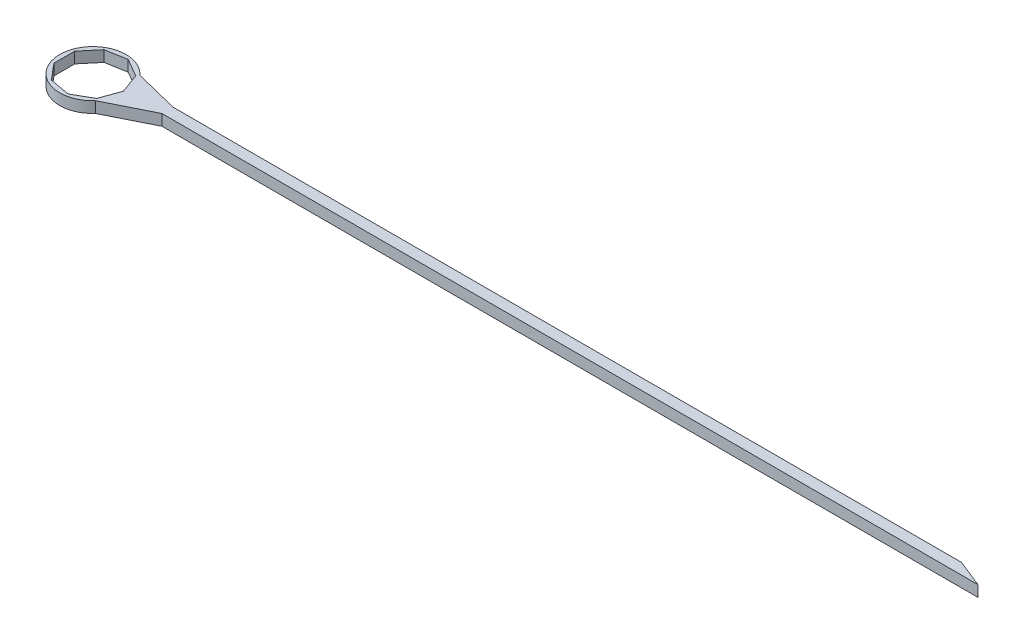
ISO-10303-21;
HEADER;
FILE_DESCRIPTION(('STEP AP214'),'2;1');
FILE_NAME('part.step','',(''),(''),'','','');
FILE_SCHEMA(('AUTOMOTIVE_DESIGN { 1 0 10303 214 1 1 1 1 }'));
ENDSEC;
DATA;
#1=APPLICATION_CONTEXT('core data for automotive mechanical design processes');
#2=APPLICATION_PROTOCOL_DEFINITION('international standard','automotive_design',2000,#1);
#3=PRODUCT_CONTEXT('',#1,'mechanical');
#4=PRODUCT('Part','Part','',(#3));
#5=PRODUCT_RELATED_PRODUCT_CATEGORY('part','',(#4));
#6=PRODUCT_DEFINITION_FORMATION('','',#4);
#7=PRODUCT_DEFINITION_CONTEXT('part definition',#1,'design');
#8=PRODUCT_DEFINITION('design','',#6,#7);
#9=PRODUCT_DEFINITION_SHAPE('','',#8);
#10=(LENGTH_UNIT() NAMED_UNIT(*) SI_UNIT(.MILLI.,.METRE.));
#11=(NAMED_UNIT(*) PLANE_ANGLE_UNIT() SI_UNIT($,.RADIAN.));
#12=(NAMED_UNIT(*) SI_UNIT($,.STERADIAN.) SOLID_ANGLE_UNIT());
#13=UNCERTAINTY_MEASURE_WITH_UNIT(LENGTH_MEASURE(1.E-05),#10,'distance_accuracy_value','');
#14=(GEOMETRIC_REPRESENTATION_CONTEXT(3) GLOBAL_UNCERTAINTY_ASSIGNED_CONTEXT((#13)) GLOBAL_UNIT_ASSIGNED_CONTEXT((#10,
#11,#12)) REPRESENTATION_CONTEXT('',''));
#15=CARTESIAN_POINT('',(0.,0.,0.));
#16=DIRECTION('',(0.,0.,1.));
#17=DIRECTION('',(1.,0.,0.));
#18=AXIS2_PLACEMENT_3D('',#15,#16,#17);
#19=CARTESIAN_POINT('',(0.,1.,0.));
#20=DIRECTION('',(0.,1.,0.));
#21=DIRECTION('',(0.,0.,1.));
#22=AXIS2_PLACEMENT_3D('',#19,#20,#21);
#23=PLANE('',#22);
#24=DIRECTION('',(0.894427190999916,0.,-0.447213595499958));
#25=VECTOR('',#24,1.);
#26=CARTESIAN_POINT('',(6.23606797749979,1.,0.));
#27=LINE('',#26,#25);
#28=CARTESIAN_POINT('',(2.23606797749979,1.,2.));
#29=VERTEX_POINT('',#28);
#30=CARTESIAN_POINT('',(6.23606797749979,1.,0.));
#31=VERTEX_POINT('',#30);
#32=EDGE_CURVE('E211',#29,#31,#27,.T.);
#33=ORIENTED_EDGE('',*,*,#32,.T.);
#34=DIRECTION('',(1.,0.,0.));
#35=VECTOR('',#34,1.);
#36=CARTESIAN_POINT('',(6.23606797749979,1.,0.));
#37=LINE('',#36,#35);
#38=CARTESIAN_POINT('',(80.,1.,0.));
#39=VERTEX_POINT('',#38);
#40=EDGE_CURVE('E214',#31,#39,#37,.T.);
#41=ORIENTED_EDGE('',*,*,#40,.T.);
#42=DIRECTION('',(-0.928476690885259,0.,-0.371390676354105));
#43=VECTOR('',#42,1.);
#44=CARTESIAN_POINT('',(80.,1.,0.));
#45=LINE('',#44,#43);
#46=CARTESIAN_POINT('',(77.5,1.,-1.00000000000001));
#47=VERTEX_POINT('',#46);
#48=EDGE_CURVE('E217',#39,#47,#45,.T.);
#49=ORIENTED_EDGE('',*,*,#48,.T.);
#50=DIRECTION('',(-1.,0.,0.));
#51=VECTOR('',#50,1.);
#52=CARTESIAN_POINT('',(77.5,1.,-1.00000000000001));
#53=LINE('',#52,#51);
#54=CARTESIAN_POINT('',(6.23606797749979,1.,-0.999999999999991));
#55=VERTEX_POINT('',#54);
#56=EDGE_CURVE('E219',#47,#55,#53,.T.);
#57=ORIENTED_EDGE('',*,*,#56,.T.);
#58=DIRECTION('',(-0.970142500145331,0.,-0.242535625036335));
#59=VECTOR('',#58,1.);
#60=CARTESIAN_POINT('',(6.23606797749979,1.,-0.999999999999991));
#61=LINE('',#60,#59);
#62=CARTESIAN_POINT('',(2.23606797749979,1.,-2.));
#63=VERTEX_POINT('',#62);
#64=EDGE_CURVE('E221',#55,#63,#61,.T.);
#65=ORIENTED_EDGE('',*,*,#64,.T.);
#66=CARTESIAN_POINT('',(0.,1.,0.));
#67=DIRECTION('',(0.,1.,0.));
#68=DIRECTION('',(0.,0.,1.));
#69=AXIS2_PLACEMENT_3D('',#66,#67,#68);
#70=CIRCLE('',#69,3.);
#71=EDGE_CURVE('E223',#63,#29,#70,.T.);
#72=ORIENTED_EDGE('',*,*,#71,.T.);
#73=EDGE_LOOP('',(#33,#41,#49,#57,#65,#72));
#74=FACE_BOUND('',#73,.T.);
#75=DIRECTION('',(-0.342020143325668,0.,-0.939692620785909));
#76=VECTOR('',#75,1.);
#77=CARTESIAN_POINT('',(2.75,1.,0.));
#78=LINE('',#77,#76);
#79=CARTESIAN_POINT('',(2.75,1.,0.));
#80=VERTEX_POINT('',#79);
#81=CARTESIAN_POINT('',(2.10662221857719,1.,-1.76766592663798));
#82=VERTEX_POINT('',#81);
#83=EDGE_CURVE('E147',#80,#82,#78,.T.);
#84=ORIENTED_EDGE('',*,*,#83,.F.);
#85=DIRECTION('',(0.342020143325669,0.,-0.939692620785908));
#86=VECTOR('',#85,1.);
#87=CARTESIAN_POINT('',(2.10662221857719,1.,1.76766592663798));
#88=LINE('',#87,#86);
#89=CARTESIAN_POINT('',(2.10662221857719,1.,1.76766592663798));
#90=VERTEX_POINT('',#89);
#91=EDGE_CURVE('E139',#90,#80,#88,.T.);
#92=ORIENTED_EDGE('',*,*,#91,.F.);
#93=DIRECTION('',(0.866025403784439,0.,-0.5));
#94=VECTOR('',#93,1.);
#95=CARTESIAN_POINT('',(0.477532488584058,1.,2.70822132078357));
#96=LINE('',#95,#94);
#97=CARTESIAN_POINT('',(0.477532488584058,1.,2.70822132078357));
#98=VERTEX_POINT('',#97);
#99=EDGE_CURVE('E174',#98,#90,#96,.T.);
#100=ORIENTED_EDGE('',*,*,#99,.F.);
#101=DIRECTION('',(0.984807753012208,0.,0.17364817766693));
#102=VECTOR('',#101,1.);
#103=CARTESIAN_POINT('',(-1.375,1.,2.38156986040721));
#104=LINE('',#103,#102);
#105=CARTESIAN_POINT('',(-1.375,1.,2.38156986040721));
#106=VERTEX_POINT('',#105);
#107=EDGE_CURVE('E172',#106,#98,#104,.T.);
#108=ORIENTED_EDGE('',*,*,#107,.F.);
#109=DIRECTION('',(0.642787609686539,0.,0.766044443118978));
#110=VECTOR('',#109,1.);
#111=CARTESIAN_POINT('',(-2.58415470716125,1.,0.940555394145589));
#112=LINE('',#111,#110);
#113=CARTESIAN_POINT('',(-2.58415470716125,1.,0.940555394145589));
#114=VERTEX_POINT('',#113);
#115=EDGE_CURVE('E170',#114,#106,#112,.T.);
#116=ORIENTED_EDGE('',*,*,#115,.F.);
#117=DIRECTION('',(0.,0.,1.));
#118=VECTOR('',#117,1.);
#119=CARTESIAN_POINT('',(-2.58415470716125,1.,-0.940555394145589));
#120=LINE('',#119,#118);
#121=CARTESIAN_POINT('',(-2.58415470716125,1.,-0.940555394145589));
#122=VERTEX_POINT('',#121);
#123=EDGE_CURVE('E168',#122,#114,#120,.T.);
#124=ORIENTED_EDGE('',*,*,#123,.F.);
#125=DIRECTION('',(-0.642787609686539,0.,0.766044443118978));
#126=VECTOR('',#125,1.);
#127=CARTESIAN_POINT('',(-1.375,1.,-2.38156986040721));
#128=LINE('',#127,#126);
#129=CARTESIAN_POINT('',(-1.375,1.,-2.38156986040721));
#130=VERTEX_POINT('',#129);
#131=EDGE_CURVE('E166',#130,#122,#128,.T.);
#132=ORIENTED_EDGE('',*,*,#131,.F.);
#133=DIRECTION('',(-0.984807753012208,0.,0.17364817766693));
#134=VECTOR('',#133,1.);
#135=CARTESIAN_POINT('',(0.477532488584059,1.,-2.70822132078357));
#136=LINE('',#135,#134);
#137=CARTESIAN_POINT('',(0.477532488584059,1.,-2.70822132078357));
#138=VERTEX_POINT('',#137);
#139=EDGE_CURVE('E162',#138,#130,#136,.T.);
#140=ORIENTED_EDGE('',*,*,#139,.F.);
#141=DIRECTION('',(-0.866025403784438,0.,-0.500000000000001));
#142=VECTOR('',#141,1.);
#143=CARTESIAN_POINT('',(2.10662221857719,1.,-1.76766592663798));
#144=LINE('',#143,#142);
#145=EDGE_CURVE('E160',#82,#138,#144,.T.);
#146=ORIENTED_EDGE('',*,*,#145,.F.);
#147=EDGE_LOOP('',(#84,#92,#100,#108,#116,#124,#132,#140,#146));
#148=FACE_BOUND('',#147,.T.);
#149=ADVANCED_FACE('F32',(#74,#148),#23,.T.);
#150=CARTESIAN_POINT('',(0.,0.,0.));
#151=DIRECTION('',(0.,1.,0.));
#152=DIRECTION('',(0.,0.,1.));
#153=AXIS2_PLACEMENT_3D('',#150,#151,#152);
#154=PLANE('',#153);
#155=DIRECTION('',(0.894427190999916,0.,-0.447213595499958));
#156=VECTOR('',#155,1.);
#157=CARTESIAN_POINT('',(6.23606797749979,0.,0.));
#158=LINE('',#157,#156);
#159=CARTESIAN_POINT('',(2.23606797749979,0.,2.));
#160=VERTEX_POINT('',#159);
#161=CARTESIAN_POINT('',(6.23606797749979,0.,0.));
#162=VERTEX_POINT('',#161);
#163=EDGE_CURVE('E155',#160,#162,#158,.T.);
#164=ORIENTED_EDGE('',*,*,#163,.F.);
#165=CARTESIAN_POINT('',(0.,0.,0.));
#166=DIRECTION('',(0.,1.,0.));
#167=DIRECTION('',(0.,0.,1.));
#168=AXIS2_PLACEMENT_3D('',#165,#166,#167);
#169=CIRCLE('',#168,3.);
#170=CARTESIAN_POINT('',(2.23606797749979,0.,-2.));
#171=VERTEX_POINT('',#170);
#172=EDGE_CURVE('E215',#171,#160,#169,.T.);
#173=ORIENTED_EDGE('',*,*,#172,.F.);
#174=DIRECTION('',(-0.970142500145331,0.,-0.242535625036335));
#175=VECTOR('',#174,1.);
#176=CARTESIAN_POINT('',(6.23606797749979,0.,-0.999999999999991));
#177=LINE('',#176,#175);
#178=CARTESIAN_POINT('',(6.23606797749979,0.,-0.999999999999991));
#179=VERTEX_POINT('',#178);
#180=EDGE_CURVE('E234',#179,#171,#177,.T.);
#181=ORIENTED_EDGE('',*,*,#180,.F.);
#182=DIRECTION('',(-1.,0.,0.));
#183=VECTOR('',#182,1.);
#184=CARTESIAN_POINT('',(77.5,0.,-1.00000000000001));
#185=LINE('',#184,#183);
#186=CARTESIAN_POINT('',(77.5,0.,-1.00000000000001));
#187=VERTEX_POINT('',#186);
#188=EDGE_CURVE('E232',#187,#179,#185,.T.);
#189=ORIENTED_EDGE('',*,*,#188,.F.);
#190=DIRECTION('',(-0.928476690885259,0.,-0.371390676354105));
#191=VECTOR('',#190,1.);
#192=CARTESIAN_POINT('',(80.,0.,0.));
#193=LINE('',#192,#191);
#194=CARTESIAN_POINT('',(80.,0.,0.));
#195=VERTEX_POINT('',#194);
#196=EDGE_CURVE('E230',#195,#187,#193,.T.);
#197=ORIENTED_EDGE('',*,*,#196,.F.);
#198=DIRECTION('',(1.,0.,0.));
#199=VECTOR('',#198,1.);
#200=CARTESIAN_POINT('',(6.23606797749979,0.,0.));
#201=LINE('',#200,#199);
#202=EDGE_CURVE('E228',#162,#195,#201,.T.);
#203=ORIENTED_EDGE('',*,*,#202,.F.);
#204=EDGE_LOOP('',(#164,#173,#181,#189,#197,#203));
#205=FACE_BOUND('',#204,.T.);
#206=DIRECTION('',(0.342020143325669,0.,-0.939692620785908));
#207=VECTOR('',#206,1.);
#208=CARTESIAN_POINT('',(2.10662221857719,0.,1.76766592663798));
#209=LINE('',#208,#207);
#210=CARTESIAN_POINT('',(2.10662221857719,0.,1.76766592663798));
#211=VERTEX_POINT('',#210);
#212=CARTESIAN_POINT('',(2.75,0.,0.));
#213=VERTEX_POINT('',#212);
#214=EDGE_CURVE('E55',#211,#213,#209,.T.);
#215=ORIENTED_EDGE('',*,*,#214,.T.);
#216=DIRECTION('',(-0.342020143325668,0.,-0.939692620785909));
#217=VECTOR('',#216,1.);
#218=CARTESIAN_POINT('',(2.75,0.,0.));
#219=LINE('',#218,#217);
#220=CARTESIAN_POINT('',(2.10662221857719,0.,-1.76766592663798));
#221=VERTEX_POINT('',#220);
#222=EDGE_CURVE('E154',#213,#221,#219,.T.);
#223=ORIENTED_EDGE('',*,*,#222,.T.);
#224=DIRECTION('',(-0.866025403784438,0.,-0.500000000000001));
#225=VECTOR('',#224,1.);
#226=CARTESIAN_POINT('',(2.10662221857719,0.,-1.76766592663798));
#227=LINE('',#226,#225);
#228=CARTESIAN_POINT('',(0.477532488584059,0.,-2.70822132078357));
#229=VERTEX_POINT('',#228);
#230=EDGE_CURVE('E178',#221,#229,#227,.T.);
#231=ORIENTED_EDGE('',*,*,#230,.T.);
#232=DIRECTION('',(-0.984807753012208,0.,0.17364817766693));
#233=VECTOR('',#232,1.);
#234=CARTESIAN_POINT('',(0.477532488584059,0.,-2.70822132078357));
#235=LINE('',#234,#233);
#236=CARTESIAN_POINT('',(-1.375,0.,-2.38156986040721));
#237=VERTEX_POINT('',#236);
#238=EDGE_CURVE('E181',#229,#237,#235,.T.);
#239=ORIENTED_EDGE('',*,*,#238,.T.);
#240=DIRECTION('',(-0.642787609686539,0.,0.766044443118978));
#241=VECTOR('',#240,1.);
#242=CARTESIAN_POINT('',(-1.375,0.,-2.38156986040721));
#243=LINE('',#242,#241);
#244=CARTESIAN_POINT('',(-2.58415470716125,0.,-0.940555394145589));
#245=VERTEX_POINT('',#244);
#246=EDGE_CURVE('E184',#237,#245,#243,.T.);
#247=ORIENTED_EDGE('',*,*,#246,.T.);
#248=DIRECTION('',(0.,0.,1.));
#249=VECTOR('',#248,1.);
#250=CARTESIAN_POINT('',(-2.58415470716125,0.,-0.940555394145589));
#251=LINE('',#250,#249);
#252=CARTESIAN_POINT('',(-2.58415470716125,0.,0.940555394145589));
#253=VERTEX_POINT('',#252);
#254=EDGE_CURVE('E187',#245,#253,#251,.T.);
#255=ORIENTED_EDGE('',*,*,#254,.T.);
#256=DIRECTION('',(0.642787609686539,0.,0.766044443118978));
#257=VECTOR('',#256,1.);
#258=CARTESIAN_POINT('',(-2.58415470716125,0.,0.940555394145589));
#259=LINE('',#258,#257);
#260=CARTESIAN_POINT('',(-1.375,0.,2.38156986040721));
#261=VERTEX_POINT('',#260);
#262=EDGE_CURVE('E190',#253,#261,#259,.T.);
#263=ORIENTED_EDGE('',*,*,#262,.T.);
#264=DIRECTION('',(0.984807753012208,0.,0.17364817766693));
#265=VECTOR('',#264,1.);
#266=CARTESIAN_POINT('',(-1.375,0.,2.38156986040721));
#267=LINE('',#266,#265);
#268=CARTESIAN_POINT('',(0.477532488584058,0.,2.70822132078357));
#269=VERTEX_POINT('',#268);
#270=EDGE_CURVE('E193',#261,#269,#267,.T.);
#271=ORIENTED_EDGE('',*,*,#270,.T.);
#272=DIRECTION('',(0.866025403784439,0.,-0.5));
#273=VECTOR('',#272,1.);
#274=CARTESIAN_POINT('',(0.477532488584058,0.,2.70822132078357));
#275=LINE('',#274,#273);
#276=EDGE_CURVE('E148',#269,#211,#275,.T.);
#277=ORIENTED_EDGE('',*,*,#276,.T.);
#278=EDGE_LOOP('',(#215,#223,#231,#239,#247,#255,#263,#271,#277));
#279=FACE_BOUND('',#278,.T.);
#280=ADVANCED_FACE('F258',(#205,#279),#154,.F.);
#281=CARTESIAN_POINT('',(6.23606797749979,1.,0.));
#282=DIRECTION('',(-0.447213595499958,0.,-0.894427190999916));
#283=DIRECTION('',(-0.894427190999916,0.,0.447213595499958));
#284=AXIS2_PLACEMENT_3D('',#281,#282,#283);
#285=PLANE('',#284);
#286=ORIENTED_EDGE('',*,*,#163,.T.);
#287=DIRECTION('',(0.,-1.,0.));
#288=VECTOR('',#287,1.);
#289=CARTESIAN_POINT('',(6.23606797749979,1.,0.));
#290=LINE('',#289,#288);
#291=EDGE_CURVE('E11',#31,#162,#290,.T.);
#292=ORIENTED_EDGE('',*,*,#291,.F.);
#293=ORIENTED_EDGE('',*,*,#32,.F.);
#294=DIRECTION('',(0.,-1.,0.));
#295=VECTOR('',#294,1.);
#296=CARTESIAN_POINT('',(2.23606797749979,1.,2.));
#297=LINE('',#296,#295);
#298=EDGE_CURVE('E225',#29,#160,#297,.T.);
#299=ORIENTED_EDGE('',*,*,#298,.T.);
#300=EDGE_LOOP('',(#286,#292,#293,#299));
#301=FACE_BOUND('',#300,.T.);
#302=ADVANCED_FACE('F34',(#301),#285,.F.);
#303=CARTESIAN_POINT('',(6.23606797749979,1.,0.));
#304=DIRECTION('',(0.,0.,-1.));
#305=DIRECTION('',(-1.,0.,0.));
#306=AXIS2_PLACEMENT_3D('',#303,#304,#305);
#307=PLANE('',#306);
#308=ORIENTED_EDGE('',*,*,#202,.T.);
#309=DIRECTION('',(0.,-1.,0.));
#310=VECTOR('',#309,1.);
#311=CARTESIAN_POINT('',(80.,1.,0.));
#312=LINE('',#311,#310);
#313=EDGE_CURVE('E40',#39,#195,#312,.T.);
#314=ORIENTED_EDGE('',*,*,#313,.F.);
#315=ORIENTED_EDGE('',*,*,#40,.F.);
#316=ORIENTED_EDGE('',*,*,#291,.T.);
#317=EDGE_LOOP('',(#308,#314,#315,#316));
#318=FACE_BOUND('',#317,.T.);
#319=ADVANCED_FACE('F275',(#318),#307,.F.);
#320=CARTESIAN_POINT('',(80.,1.,0.));
#321=DIRECTION('',(-0.371390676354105,0.,0.928476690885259));
#322=DIRECTION('',(0.928476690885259,0.,0.371390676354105));
#323=AXIS2_PLACEMENT_3D('',#320,#321,#322);
#324=PLANE('',#323);
#325=ORIENTED_EDGE('',*,*,#196,.T.);
#326=DIRECTION('',(0.,-1.,0.));
#327=VECTOR('',#326,1.);
#328=CARTESIAN_POINT('',(77.5,1.,-1.00000000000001));
#329=LINE('',#328,#327);
#330=EDGE_CURVE('E245',#47,#187,#329,.T.);
#331=ORIENTED_EDGE('',*,*,#330,.F.);
#332=ORIENTED_EDGE('',*,*,#48,.F.);
#333=ORIENTED_EDGE('',*,*,#313,.T.);
#334=EDGE_LOOP('',(#325,#331,#332,#333));
#335=FACE_BOUND('',#334,.T.);
#336=ADVANCED_FACE('F252',(#335),#324,.F.);
#337=CARTESIAN_POINT('',(77.5,1.,-1.00000000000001));
#338=DIRECTION('',(0.,0.,1.));
#339=DIRECTION('',(1.,0.,0.));
#340=AXIS2_PLACEMENT_3D('',#337,#338,#339);
#341=PLANE('',#340);
#342=ORIENTED_EDGE('',*,*,#188,.T.);
#343=DIRECTION('',(0.,-1.,0.));
#344=VECTOR('',#343,1.);
#345=CARTESIAN_POINT('',(6.23606797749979,1.,-0.999999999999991));
#346=LINE('',#345,#344);
#347=EDGE_CURVE('E242',#55,#179,#346,.T.);
#348=ORIENTED_EDGE('',*,*,#347,.F.);
#349=ORIENTED_EDGE('',*,*,#56,.F.);
#350=ORIENTED_EDGE('',*,*,#330,.T.);
#351=EDGE_LOOP('',(#342,#348,#349,#350));
#352=FACE_BOUND('',#351,.T.);
#353=ADVANCED_FACE('F264',(#352),#341,.F.);
#354=CARTESIAN_POINT('',(6.23606797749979,1.,-0.999999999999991));
#355=DIRECTION('',(-0.242535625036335,0.,0.970142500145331));
#356=DIRECTION('',(0.970142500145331,0.,0.242535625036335));
#357=AXIS2_PLACEMENT_3D('',#354,#355,#356);
#358=PLANE('',#357);
#359=ORIENTED_EDGE('',*,*,#180,.T.);
#360=DIRECTION('',(0.,-1.,0.));
#361=VECTOR('',#360,1.);
#362=CARTESIAN_POINT('',(2.23606797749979,1.,-2.));
#363=LINE('',#362,#361);
#364=EDGE_CURVE('E239',#63,#171,#363,.T.);
#365=ORIENTED_EDGE('',*,*,#364,.F.);
#366=ORIENTED_EDGE('',*,*,#64,.F.);
#367=ORIENTED_EDGE('',*,*,#347,.T.);
#368=EDGE_LOOP('',(#359,#365,#366,#367));
#369=FACE_BOUND('',#368,.T.);
#370=ADVANCED_FACE('F268',(#369),#358,.F.);
#371=CARTESIAN_POINT('',(0.,1.,0.));
#372=DIRECTION('',(0.,-1.,0.));
#373=DIRECTION('',(0.,0.,-1.));
#374=AXIS2_PLACEMENT_3D('',#371,#372,#373);
#375=CYLINDRICAL_SURFACE('',#374,3.);
#376=ORIENTED_EDGE('',*,*,#172,.T.);
#377=ORIENTED_EDGE('',*,*,#298,.F.);
#378=ORIENTED_EDGE('',*,*,#71,.F.);
#379=ORIENTED_EDGE('',*,*,#364,.T.);
#380=EDGE_LOOP('',(#376,#377,#378,#379));
#381=FACE_BOUND('',#380,.T.);
#382=ADVANCED_FACE('F278',(#381),#375,.T.);
#383=CARTESIAN_POINT('',(2.10662221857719,1.,1.76766592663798));
#384=DIRECTION('',(-0.939692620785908,0.,-0.342020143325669));
#385=DIRECTION('',(-0.342020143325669,0.,0.939692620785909));
#386=AXIS2_PLACEMENT_3D('',#383,#384,#385);
#387=PLANE('',#386);
#388=ORIENTED_EDGE('',*,*,#214,.F.);
#389=DIRECTION('',(0.,-1.,0.));
#390=VECTOR('',#389,1.);
#391=CARTESIAN_POINT('',(2.10662221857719,1.,1.76766592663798));
#392=LINE('',#391,#390);
#393=EDGE_CURVE('E143',#90,#211,#392,.T.);
#394=ORIENTED_EDGE('',*,*,#393,.F.);
#395=ORIENTED_EDGE('',*,*,#91,.T.);
#396=DIRECTION('',(0.,-1.,0.));
#397=VECTOR('',#396,1.);
#398=CARTESIAN_POINT('',(2.75,1.,0.));
#399=LINE('',#398,#397);
#400=EDGE_CURVE('E142',#80,#213,#399,.T.);
#401=ORIENTED_EDGE('',*,*,#400,.T.);
#402=EDGE_LOOP('',(#388,#394,#395,#401));
#403=FACE_BOUND('',#402,.T.);
#404=ADVANCED_FACE('F141',(#403),#387,.T.);
#405=CARTESIAN_POINT('',(2.75,1.,0.));
#406=DIRECTION('',(-0.939692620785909,0.,0.342020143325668));
#407=DIRECTION('',(0.342020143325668,0.,0.939692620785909));
#408=AXIS2_PLACEMENT_3D('',#405,#406,#407);
#409=PLANE('',#408);
#410=ORIENTED_EDGE('',*,*,#222,.F.);
#411=ORIENTED_EDGE('',*,*,#400,.F.);
#412=ORIENTED_EDGE('',*,*,#83,.T.);
#413=DIRECTION('',(0.,-1.,0.));
#414=VECTOR('',#413,1.);
#415=CARTESIAN_POINT('',(2.10662221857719,1.,-1.76766592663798));
#416=LINE('',#415,#414);
#417=EDGE_CURVE('E156',#82,#221,#416,.T.);
#418=ORIENTED_EDGE('',*,*,#417,.T.);
#419=EDGE_LOOP('',(#410,#411,#412,#418));
#420=FACE_BOUND('',#419,.T.);
#421=ADVANCED_FACE('F151',(#420),#409,.T.);
#422=CARTESIAN_POINT('',(2.10662221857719,1.,-1.76766592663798));
#423=DIRECTION('',(-0.500000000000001,0.,0.866025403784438));
#424=DIRECTION('',(0.866025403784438,0.,0.500000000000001));
#425=AXIS2_PLACEMENT_3D('',#422,#423,#424);
#426=PLANE('',#425);
#427=ORIENTED_EDGE('',*,*,#230,.F.);
#428=ORIENTED_EDGE('',*,*,#417,.F.);
#429=ORIENTED_EDGE('',*,*,#145,.T.);
#430=DIRECTION('',(0.,-1.,0.));
#431=VECTOR('',#430,1.);
#432=CARTESIAN_POINT('',(0.477532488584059,1.,-2.70822132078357));
#433=LINE('',#432,#431);
#434=EDGE_CURVE('E208',#138,#229,#433,.T.);
#435=ORIENTED_EDGE('',*,*,#434,.T.);
#436=EDGE_LOOP('',(#427,#428,#429,#435));
#437=FACE_BOUND('',#436,.T.);
#438=ADVANCED_FACE('F296',(#437),#426,.T.);
#439=CARTESIAN_POINT('',(0.477532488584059,1.,-2.70822132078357));
#440=DIRECTION('',(0.17364817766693,0.,0.984807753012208));
#441=DIRECTION('',(0.984807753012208,0.,-0.17364817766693));
#442=AXIS2_PLACEMENT_3D('',#439,#440,#441);
#443=PLANE('',#442);
#444=ORIENTED_EDGE('',*,*,#238,.F.);
#445=ORIENTED_EDGE('',*,*,#434,.F.);
#446=ORIENTED_EDGE('',*,*,#139,.T.);
#447=DIRECTION('',(0.,-1.,0.));
#448=VECTOR('',#447,1.);
#449=CARTESIAN_POINT('',(-1.375,1.,-2.38156986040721));
#450=LINE('',#449,#448);
#451=EDGE_CURVE('E206',#130,#237,#450,.T.);
#452=ORIENTED_EDGE('',*,*,#451,.T.);
#453=EDGE_LOOP('',(#444,#445,#446,#452));
#454=FACE_BOUND('',#453,.T.);
#455=ADVANCED_FACE('F299',(#454),#443,.T.);
#456=CARTESIAN_POINT('',(-1.375,1.,-2.38156986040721));
#457=DIRECTION('',(0.766044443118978,0.,0.642787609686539));
#458=DIRECTION('',(0.642787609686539,0.,-0.766044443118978));
#459=AXIS2_PLACEMENT_3D('',#456,#457,#458);
#460=PLANE('',#459);
#461=ORIENTED_EDGE('',*,*,#246,.F.);
#462=ORIENTED_EDGE('',*,*,#451,.F.);
#463=ORIENTED_EDGE('',*,*,#131,.T.);
#464=DIRECTION('',(0.,-1.,0.));
#465=VECTOR('',#464,1.);
#466=CARTESIAN_POINT('',(-2.58415470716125,1.,-0.940555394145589));
#467=LINE('',#466,#465);
#468=EDGE_CURVE('E204',#122,#245,#467,.T.);
#469=ORIENTED_EDGE('',*,*,#468,.T.);
#470=EDGE_LOOP('',(#461,#462,#463,#469));
#471=FACE_BOUND('',#470,.T.);
#472=ADVANCED_FACE('F303',(#471),#460,.T.);
#473=CARTESIAN_POINT('',(-2.58415470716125,1.,-0.940555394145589));
#474=DIRECTION('',(1.,0.,0.));
#475=DIRECTION('',(0.,0.,-1.));
#476=AXIS2_PLACEMENT_3D('',#473,#474,#475);
#477=PLANE('',#476);
#478=ORIENTED_EDGE('',*,*,#254,.F.);
#479=ORIENTED_EDGE('',*,*,#468,.F.);
#480=ORIENTED_EDGE('',*,*,#123,.T.);
#481=DIRECTION('',(0.,-1.,0.));
#482=VECTOR('',#481,1.);
#483=CARTESIAN_POINT('',(-2.58415470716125,1.,0.940555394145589));
#484=LINE('',#483,#482);
#485=EDGE_CURVE('E202',#114,#253,#484,.T.);
#486=ORIENTED_EDGE('',*,*,#485,.T.);
#487=EDGE_LOOP('',(#478,#479,#480,#486));
#488=FACE_BOUND('',#487,.T.);
#489=ADVANCED_FACE('F307',(#488),#477,.T.);
#490=CARTESIAN_POINT('',(-2.58415470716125,1.,0.940555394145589));
#491=DIRECTION('',(0.766044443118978,0.,-0.642787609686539));
#492=DIRECTION('',(-0.642787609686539,0.,-0.766044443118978));
#493=AXIS2_PLACEMENT_3D('',#490,#491,#492);
#494=PLANE('',#493);
#495=ORIENTED_EDGE('',*,*,#262,.F.);
#496=ORIENTED_EDGE('',*,*,#485,.F.);
#497=ORIENTED_EDGE('',*,*,#115,.T.);
#498=DIRECTION('',(0.,-1.,0.));
#499=VECTOR('',#498,1.);
#500=CARTESIAN_POINT('',(-1.375,1.,2.38156986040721));
#501=LINE('',#500,#499);
#502=EDGE_CURVE('E200',#106,#261,#501,.T.);
#503=ORIENTED_EDGE('',*,*,#502,.T.);
#504=EDGE_LOOP('',(#495,#496,#497,#503));
#505=FACE_BOUND('',#504,.T.);
#506=ADVANCED_FACE('F311',(#505),#494,.T.);
#507=CARTESIAN_POINT('',(-1.375,1.,2.38156986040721));
#508=DIRECTION('',(0.17364817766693,0.,-0.984807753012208));
#509=DIRECTION('',(-0.984807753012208,0.,-0.17364817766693));
#510=AXIS2_PLACEMENT_3D('',#507,#508,#509);
#511=PLANE('',#510);
#512=ORIENTED_EDGE('',*,*,#270,.F.);
#513=ORIENTED_EDGE('',*,*,#502,.F.);
#514=ORIENTED_EDGE('',*,*,#107,.T.);
#515=DIRECTION('',(0.,-1.,0.));
#516=VECTOR('',#515,1.);
#517=CARTESIAN_POINT('',(0.477532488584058,1.,2.70822132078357));
#518=LINE('',#517,#516);
#519=EDGE_CURVE('E47',#98,#269,#518,.T.);
#520=ORIENTED_EDGE('',*,*,#519,.T.);
#521=EDGE_LOOP('',(#512,#513,#514,#520));
#522=FACE_BOUND('',#521,.T.);
#523=ADVANCED_FACE('F315',(#522),#511,.T.);
#524=CARTESIAN_POINT('',(0.477532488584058,1.,2.70822132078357));
#525=DIRECTION('',(-0.5,0.,-0.866025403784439));
#526=DIRECTION('',(-0.866025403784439,0.,0.5));
#527=AXIS2_PLACEMENT_3D('',#524,#525,#526);
#528=PLANE('',#527);
#529=ORIENTED_EDGE('',*,*,#276,.F.);
#530=ORIENTED_EDGE('',*,*,#519,.F.);
#531=ORIENTED_EDGE('',*,*,#99,.T.);
#532=ORIENTED_EDGE('',*,*,#393,.T.);
#533=EDGE_LOOP('',(#529,#530,#531,#532));
#534=FACE_BOUND('',#533,.T.);
#535=ADVANCED_FACE('F319',(#534),#528,.T.);
#536=CLOSED_SHELL('',(#149,#280,#302,#319,#336,#353,#370,#382,#404,#421,#438,#455,#472,#489,
#506,#523,#535));
#537=MANIFOLD_SOLID_BREP('B2',#536);
#538=ADVANCED_BREP_SHAPE_REPRESENTATION('',(#18,#537),#14);
#539=SHAPE_DEFINITION_REPRESENTATION(#9,#538);
ENDSEC;
END-ISO-10303-21;
